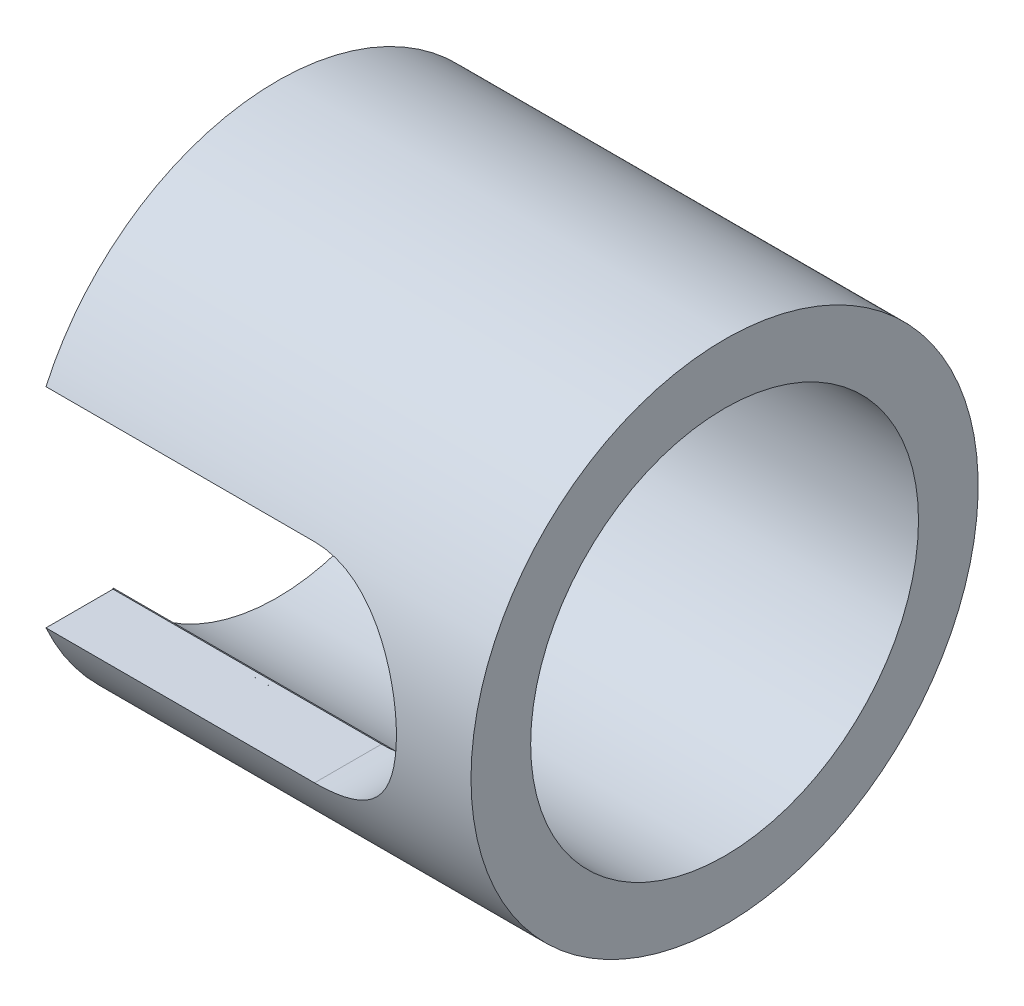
from build123d import *

# Parameters (mm, degrees)
ESQUISSE1_W             = 15
ESQUISSE1_H             = 2
ENL_V_MAT_EXTRU_1_DEPTH = 3


with BuildPart() as part:
    # Esquisse1 → Base-R_volution (revolve)
    with BuildSketch(Plane.XY, mode=Mode.PRIVATE) as base_r_volution_sk:
        with Locations((-52.5, 15)):
            Rectangle(ESQUISSE1_W, ESQUISSE1_H)
    revolve(base_r_volution_sk.sketch.rotate(Axis((-100, 7.5, 0), (1, 0, 0)), 90), axis=Axis((-100, 7.5, 0), (1, 0, 0)))

    # Esquisse2 → Enl_v. mat.-Extru.1 (cut)
    with BuildSketch(Plane.XY.offset(8.5)):
        with BuildLine():
            Line((-60, 11), (-51, 11))
            ThreePointArc((-51, 11), (-47.5, 7.5), (-51, 4))
            Line((-51, 4), (-60, 4))
            Line((-60, 4), (-60, 11))
        make_face()
    extrude(amount=-ENL_V_MAT_EXTRU_1_DEPTH, mode=Mode.SUBTRACT)


solid = part.part
